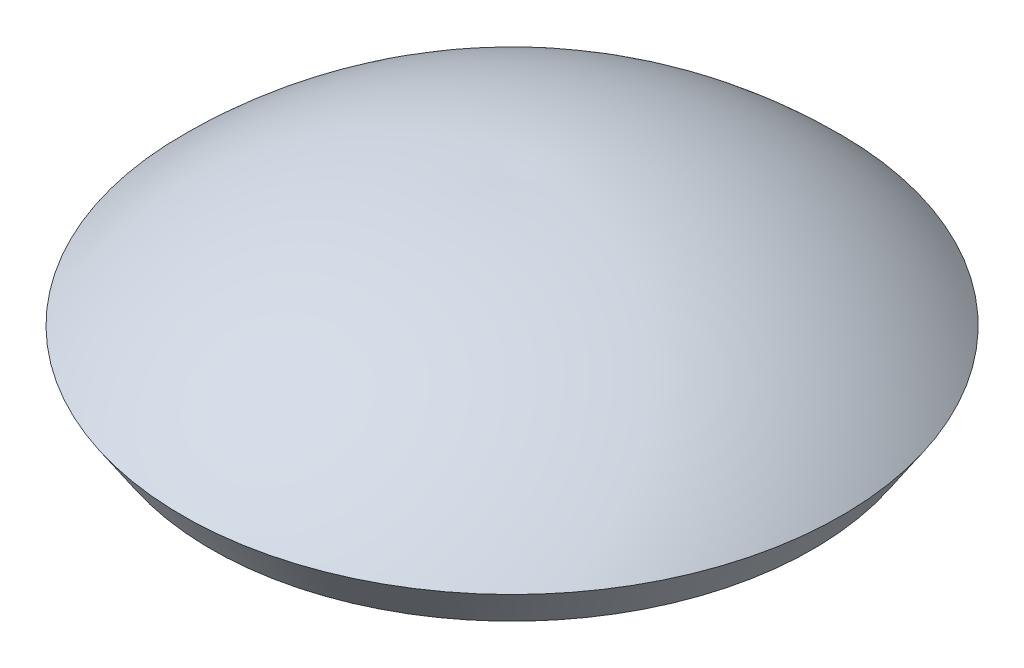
ISO-10303-21;
HEADER;
FILE_DESCRIPTION(('STEP AP214'),'2;1');
FILE_NAME('part.step','',(''),(''),'','','');
FILE_SCHEMA(('AUTOMOTIVE_DESIGN { 1 0 10303 214 1 1 1 1 }'));
ENDSEC;
DATA;
#1=APPLICATION_CONTEXT('core data for automotive mechanical design processes');
#2=APPLICATION_PROTOCOL_DEFINITION('international standard','automotive_design',2000,#1);
#3=PRODUCT_CONTEXT('',#1,'mechanical');
#4=PRODUCT('Part','Part','',(#3));
#5=PRODUCT_RELATED_PRODUCT_CATEGORY('part','',(#4));
#6=PRODUCT_DEFINITION_FORMATION('','',#4);
#7=PRODUCT_DEFINITION_CONTEXT('part definition',#1,'design');
#8=PRODUCT_DEFINITION('design','',#6,#7);
#9=PRODUCT_DEFINITION_SHAPE('','',#8);
#10=(LENGTH_UNIT() NAMED_UNIT(*) SI_UNIT(.MILLI.,.METRE.));
#11=(NAMED_UNIT(*) PLANE_ANGLE_UNIT() SI_UNIT($,.RADIAN.));
#12=(NAMED_UNIT(*) SI_UNIT($,.STERADIAN.) SOLID_ANGLE_UNIT());
#13=UNCERTAINTY_MEASURE_WITH_UNIT(LENGTH_MEASURE(1.E-05),#10,'distance_accuracy_value','');
#14=(GEOMETRIC_REPRESENTATION_CONTEXT(3) GLOBAL_UNCERTAINTY_ASSIGNED_CONTEXT((#13)) GLOBAL_UNIT_ASSIGNED_CONTEXT((#10,
#11,#12)) REPRESENTATION_CONTEXT('',''));
#15=CARTESIAN_POINT('',(0.,0.,0.));
#16=DIRECTION('',(0.,0.,1.));
#17=DIRECTION('',(1.,0.,0.));
#18=AXIS2_PLACEMENT_3D('',#15,#16,#17);
#19=CARTESIAN_POINT('',(0.,-17.5748927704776,-1.12014780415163));
#20=DIRECTION('',(-1.,0.,0.));
#21=DIRECTION('',(0.,0.,-1.));
#22=AXIS2_PLACEMENT_3D('',#19,#20,#21);
#23=CIRCLE('',#22,25.);
#24=TRIMMED_CURVE('',#23,(PARAMETER_VALUE(-1.61561724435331)),
(PARAMETER_VALUE(1.61561724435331)),.T.,.PARAMETER.);
#25=CARTESIAN_POINT('',(0.,-17.5748927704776,0.));
#26=DIRECTION('',(0.,-1.,0.));
#27=AXIS1_PLACEMENT('',#25,#26);
#28=SURFACE_OF_REVOLUTION('',#24,#27);
#29=CARTESIAN_POINT('',(0.,7.4,0.));
#30=VERTEX_POINT('',#29);
#31=VERTEX_LOOP('',#30);
#32=FACE_BOUND('',#31,.T.);
#33=CARTESIAN_POINT('',(0.,0.,0.));
#34=DIRECTION('',(0.,-1.,0.));
#35=DIRECTION('',(0.,0.,-1.));
#36=AXIS2_PLACEMENT_3D('',#33,#34,#35);
#37=CIRCLE('',#36,18.9);
#38=CARTESIAN_POINT('',(0.,0.,-18.9));
#39=VERTEX_POINT('',#38);
#40=EDGE_CURVE('E11',#39,#39,#37,.T.);
#41=ORIENTED_EDGE('',*,*,#40,.F.);
#42=EDGE_LOOP('',(#41));
#43=FACE_BOUND('',#42,.T.);
#44=ADVANCED_FACE('F35',(#32,#43),#28,.T.);
#45=CARTESIAN_POINT('',(0.,-2.5,0.));
#46=DIRECTION('',(0.,1.,0.));
#47=DIRECTION('',(0.,0.,1.));
#48=AXIS2_PLACEMENT_3D('',#45,#46,#47);
#49=CONICAL_SURFACE('',#48,17.2416876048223,0.585685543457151);
#50=ORIENTED_EDGE('',*,*,#40,.T.);
#51=EDGE_LOOP('',(#50));
#52=FACE_BOUND('',#51,.T.);
#53=CARTESIAN_POINT('',(0.,-2.5,0.));
#54=DIRECTION('',(0.,-1.,0.));
#55=DIRECTION('',(0.,0.,-1.));
#56=AXIS2_PLACEMENT_3D('',#53,#54,#55);
#57=CIRCLE('',#56,17.2416876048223);
#58=CARTESIAN_POINT('',(0.,-2.5,-17.2416876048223));
#59=VERTEX_POINT('',#58);
#60=EDGE_CURVE('E41',#59,#59,#57,.T.);
#61=ORIENTED_EDGE('',*,*,#60,.F.);
#62=EDGE_LOOP('',(#61));
#63=FACE_BOUND('',#62,.T.);
#64=ADVANCED_FACE('F46',(#52,#63),#49,.T.);
#65=CARTESIAN_POINT('',(0.,-20.591724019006,0.));
#66=DIRECTION('',(0.,-1.,0.));
#67=DIRECTION('',(-1.,0.,0.));
#68=AXIS2_PLACEMENT_3D('',#65,#66,#67);
#69=SPHERICAL_SURFACE('',#68,24.991724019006);
#70=ORIENTED_EDGE('',*,*,#60,.T.);
#71=EDGE_LOOP('',(#70));
#72=FACE_BOUND('',#71,.T.);
#73=ADVANCED_FACE('F51',(#72),#69,.F.);
#74=CLOSED_SHELL('',(#44,#64,#73));
#75=MANIFOLD_SOLID_BREP('B2',#74);
#76=ADVANCED_BREP_SHAPE_REPRESENTATION('',(#18,#75),#14);
#77=SHAPE_DEFINITION_REPRESENTATION(#9,#76);
ENDSEC;
END-ISO-10303-21;
